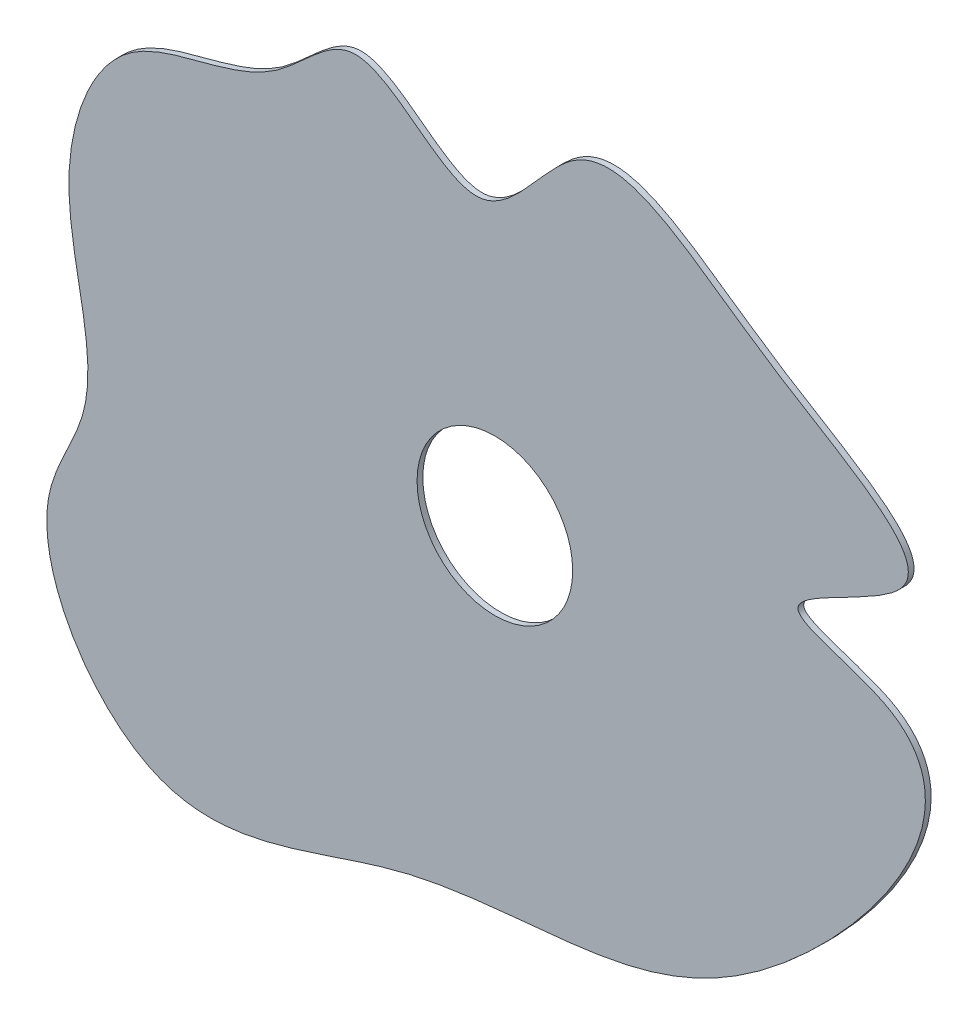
ISO-10303-21;
HEADER;
FILE_DESCRIPTION(('STEP AP214'),'2;1');
FILE_NAME('part.step','',(''),(''),'','','');
FILE_SCHEMA(('AUTOMOTIVE_DESIGN { 1 0 10303 214 1 1 1 1 }'));
ENDSEC;
DATA;
#1=APPLICATION_CONTEXT('core data for automotive mechanical design processes');
#2=APPLICATION_PROTOCOL_DEFINITION('international standard','automotive_design',2000,#1);
#3=PRODUCT_CONTEXT('',#1,'mechanical');
#4=PRODUCT('Part','Part','',(#3));
#5=PRODUCT_RELATED_PRODUCT_CATEGORY('part','',(#4));
#6=PRODUCT_DEFINITION_FORMATION('','',#4);
#7=PRODUCT_DEFINITION_CONTEXT('part definition',#1,'design');
#8=PRODUCT_DEFINITION('design','',#6,#7);
#9=PRODUCT_DEFINITION_SHAPE('','',#8);
#10=(LENGTH_UNIT() NAMED_UNIT(*) SI_UNIT(.MILLI.,.METRE.));
#11=(NAMED_UNIT(*) PLANE_ANGLE_UNIT() SI_UNIT($,.RADIAN.));
#12=(NAMED_UNIT(*) SI_UNIT($,.STERADIAN.) SOLID_ANGLE_UNIT());
#13=UNCERTAINTY_MEASURE_WITH_UNIT(LENGTH_MEASURE(1.E-05),#10,'distance_accuracy_value','');
#14=(GEOMETRIC_REPRESENTATION_CONTEXT(3) GLOBAL_UNCERTAINTY_ASSIGNED_CONTEXT((#13)) GLOBAL_UNIT_ASSIGNED_CONTEXT((#10,
#11,#12)) REPRESENTATION_CONTEXT('',''));
#15=CARTESIAN_POINT('',(0.,0.,0.));
#16=DIRECTION('',(0.,0.,1.));
#17=DIRECTION('',(1.,0.,0.));
#18=AXIS2_PLACEMENT_3D('',#15,#16,#17);
#19=CARTESIAN_POINT('',(-21.661404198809,34.0548721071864,1.));
#20=CARTESIAN_POINT('',(-29.6888162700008,28.4127176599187,1.));
#21=CARTESIAN_POINT('',(-49.8354681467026,29.489049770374,1.));
#22=CARTESIAN_POINT('',(-62.3919091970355,-3.58124951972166,1.));
#23=CARTESIAN_POINT('',(-49.5735044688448,-29.2286166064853,1.));
#24=CARTESIAN_POINT('',(-67.8035841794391,-55.1856114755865,1.));
#25=CARTESIAN_POINT('',(-42.8025483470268,-95.1435111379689,1.));
#26=CARTESIAN_POINT('',(-1.73049935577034,-71.943136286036,1.));
#27=CARTESIAN_POINT('',(37.3850016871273,-72.9632064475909,1.));
#28=CARTESIAN_POINT('',(70.622595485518,-58.0374504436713,1.));
#29=CARTESIAN_POINT('',(106.897469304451,-9.73226209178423,1.));
#30=CARTESIAN_POINT('',(56.9158477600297,-2.27669756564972,1.));
#31=CARTESIAN_POINT('',(103.098267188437,12.0429795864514,1.));
#32=CARTESIAN_POINT('',(58.3802788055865,33.1563241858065,1.));
#33=CARTESIAN_POINT('',(33.033698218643,58.8656782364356,1.));
#34=CARTESIAN_POINT('',(13.5078177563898,22.1420565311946,1.));
#35=CARTESIAN_POINT('',(-6.86923701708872,51.33812409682,1.));
#36=CARTESIAN_POINT('',(-16.8522418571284,37.4350445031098,1.));
#37=CARTESIAN_POINT('',(-21.661404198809,34.0548721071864,1.));
#38=B_SPLINE_CURVE_WITH_KNOTS('',3,(#19,#20,#21,#22,#23,#24,#25,#26,#27,#28,#29,#30,#31,#32,#33,
#34,#35,#36,#37),.UNSPECIFIED.,.T.,.F.,(4,1,1,1,1,1,1,1,1,1,1,1,1,1,1,1,4),(0.,
0.0571825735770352,0.112713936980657,0.185714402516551,0.219037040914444,0.298383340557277,
0.389371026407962,0.469137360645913,0.539977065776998,0.643888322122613,0.680328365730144,
0.725797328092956,0.790807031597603,0.870930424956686,0.91496687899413,0.965742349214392,1.),.UNSPECIFIED.);
#39=DIRECTION('',(0.,0.,-1.));
#40=VECTOR('',#39,1.);
#41=SURFACE_OF_LINEAR_EXTRUSION('',#38,#40);
#42=CARTESIAN_POINT('',(-21.661404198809,34.0548721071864,1.));
#43=VERTEX_POINT('',#42);
#44=EDGE_CURVE('E10',#43,#43,#38,.T.);
#45=ORIENTED_EDGE('',*,*,#44,.F.);
#46=EDGE_LOOP('',(#45));
#47=FACE_BOUND('',#46,.T.);
#48=CARTESIAN_POINT('',(-21.661404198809,34.0548721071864,0.));
#49=CARTESIAN_POINT('',(-29.6888162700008,28.4127176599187,0.));
#50=CARTESIAN_POINT('',(-49.8354681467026,29.489049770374,0.));
#51=CARTESIAN_POINT('',(-62.3919091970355,-3.58124951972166,0.));
#52=CARTESIAN_POINT('',(-49.5735044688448,-29.2286166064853,0.));
#53=CARTESIAN_POINT('',(-67.8035841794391,-55.1856114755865,0.));
#54=CARTESIAN_POINT('',(-42.8025483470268,-95.1435111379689,0.));
#55=CARTESIAN_POINT('',(-1.73049935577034,-71.943136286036,0.));
#56=CARTESIAN_POINT('',(37.3850016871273,-72.9632064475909,0.));
#57=CARTESIAN_POINT('',(70.622595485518,-58.0374504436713,0.));
#58=CARTESIAN_POINT('',(106.897469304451,-9.73226209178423,0.));
#59=CARTESIAN_POINT('',(56.9158477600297,-2.27669756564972,0.));
#60=CARTESIAN_POINT('',(103.098267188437,12.0429795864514,0.));
#61=CARTESIAN_POINT('',(58.3802788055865,33.1563241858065,0.));
#62=CARTESIAN_POINT('',(33.033698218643,58.8656782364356,0.));
#63=CARTESIAN_POINT('',(13.5078177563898,22.1420565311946,0.));
#64=CARTESIAN_POINT('',(-6.86923701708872,51.33812409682,0.));
#65=CARTESIAN_POINT('',(-16.8522418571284,37.4350445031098,0.));
#66=CARTESIAN_POINT('',(-21.661404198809,34.0548721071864,0.));
#67=B_SPLINE_CURVE_WITH_KNOTS('',3,(#48,#49,#50,#51,#52,#53,#54,#55,#56,#57,#58,#59,#60,#61,#62,
#63,#64,#65,#66),.UNSPECIFIED.,.T.,.F.,(4,1,1,1,1,1,1,1,1,1,1,1,1,1,1,1,4),(0.,
0.0571825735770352,0.112713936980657,0.185714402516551,0.219037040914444,0.298383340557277,
0.389371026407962,0.469137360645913,0.539977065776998,0.643888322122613,0.680328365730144,
0.725797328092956,0.790807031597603,0.870930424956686,0.91496687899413,0.965742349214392,1.),.UNSPECIFIED.);
#68=CARTESIAN_POINT('',(-21.661404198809,34.0548721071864,0.));
#69=VERTEX_POINT('',#68);
#70=EDGE_CURVE('E32',#69,#69,#67,.T.);
#71=ORIENTED_EDGE('',*,*,#70,.T.);
#72=EDGE_LOOP('',(#71));
#73=FACE_BOUND('',#72,.T.);
#74=ADVANCED_FACE('F28',(#47,#73),#41,.F.);
#75=CARTESIAN_POINT('',(50.5520992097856,-66.2296893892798,1.));
#76=DIRECTION('',(0.,0.,1.));
#77=DIRECTION('',(1.,0.,0.));
#78=AXIS2_PLACEMENT_3D('',#75,#76,#77);
#79=PLANE('',#78);
#80=CARTESIAN_POINT('',(16.2042992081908,-15.470882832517,0.999999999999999));
#81=DIRECTION('',(0.,0.,1.));
#82=DIRECTION('',(1.,0.,0.));
#83=AXIS2_PLACEMENT_3D('',#80,#81,#82);
#84=CIRCLE('',#83,13.5);
#85=CARTESIAN_POINT('',(29.7042992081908,-15.470882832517,0.999999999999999));
#86=VERTEX_POINT('',#85);
#87=EDGE_CURVE('E40',#86,#86,#84,.T.);
#88=ORIENTED_EDGE('',*,*,#87,.F.);
#89=EDGE_LOOP('',(#88));
#90=FACE_BOUND('',#89,.T.);
#91=ORIENTED_EDGE('',*,*,#44,.T.);
#92=EDGE_LOOP('',(#91));
#93=FACE_BOUND('',#92,.T.);
#94=ADVANCED_FACE('F59',(#90,#93),#79,.T.);
#95=CARTESIAN_POINT('',(50.5520992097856,-66.2296893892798,0.));
#96=DIRECTION('',(0.,0.,1.));
#97=DIRECTION('',(1.,0.,0.));
#98=AXIS2_PLACEMENT_3D('',#95,#96,#97);
#99=PLANE('',#98);
#100=CARTESIAN_POINT('',(16.2042992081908,-15.470882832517,0.));
#101=DIRECTION('',(0.,0.,-1.));
#102=DIRECTION('',(-1.,0.,0.));
#103=AXIS2_PLACEMENT_3D('',#100,#101,#102);
#104=CIRCLE('',#103,13.5);
#105=CARTESIAN_POINT('',(2.70429920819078,-15.470882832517,0.));
#106=VERTEX_POINT('',#105);
#107=EDGE_CURVE('E50',#106,#106,#104,.T.);
#108=ORIENTED_EDGE('',*,*,#107,.F.);
#109=EDGE_LOOP('',(#108));
#110=FACE_BOUND('',#109,.T.);
#111=ORIENTED_EDGE('',*,*,#70,.F.);
#112=EDGE_LOOP('',(#111));
#113=FACE_BOUND('',#112,.T.);
#114=ADVANCED_FACE('F56',(#110,#113),#99,.F.);
#115=CARTESIAN_POINT('',(16.2042992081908,-15.470882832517,10.));
#116=DIRECTION('',(0.,0.,-1.));
#117=DIRECTION('',(-1.,0.,0.));
#118=AXIS2_PLACEMENT_3D('',#115,#116,#117);
#119=CYLINDRICAL_SURFACE('',#118,13.5);
#120=ORIENTED_EDGE('',*,*,#87,.T.);
#121=EDGE_LOOP('',(#120));
#122=FACE_BOUND('',#121,.T.);
#123=ORIENTED_EDGE('',*,*,#107,.T.);
#124=EDGE_LOOP('',(#123));
#125=FACE_BOUND('',#124,.T.);
#126=ADVANCED_FACE('F54',(#122,#125),#119,.F.);
#127=CLOSED_SHELL('',(#74,#94,#114,#126));
#128=MANIFOLD_SOLID_BREP('B2',#127);
#129=ADVANCED_BREP_SHAPE_REPRESENTATION('',(#18,#128),#14);
#130=SHAPE_DEFINITION_REPRESENTATION(#9,#129);
ENDSEC;
END-ISO-10303-21;
